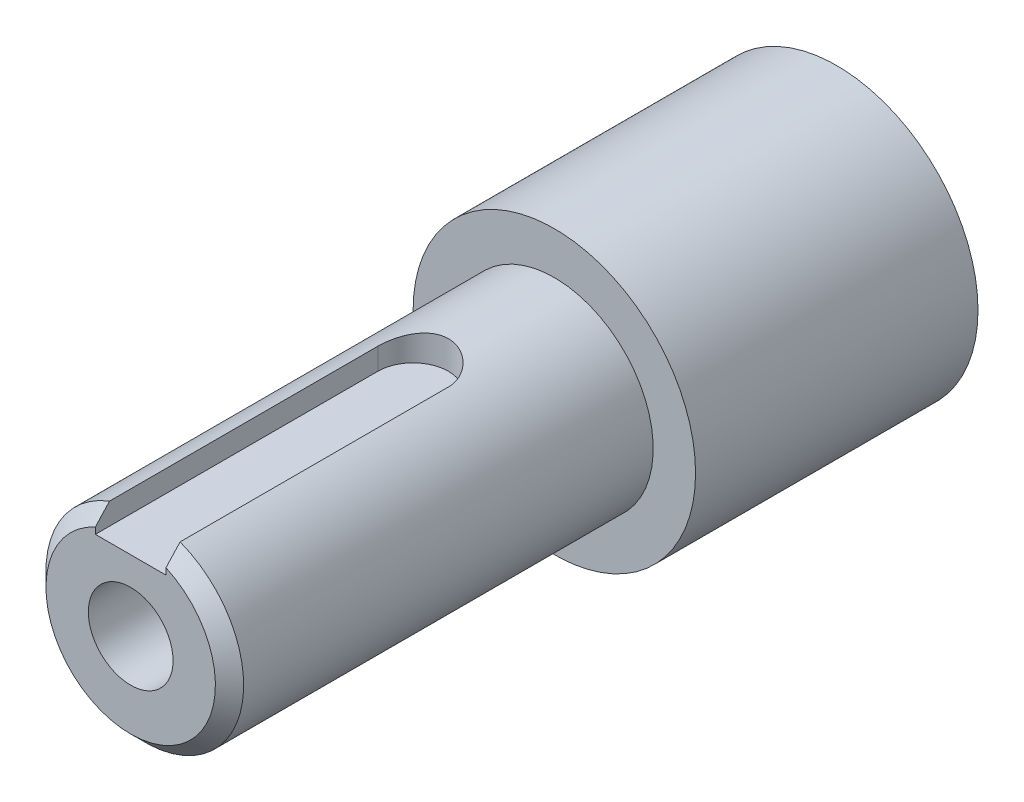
ISO-10303-21;
HEADER;
FILE_DESCRIPTION(('STEP AP214'),'2;1');
FILE_NAME('part.step','',(''),(''),'','','');
FILE_SCHEMA(('AUTOMOTIVE_DESIGN { 1 0 10303 214 1 1 1 1 }'));
ENDSEC;
DATA;
#1=APPLICATION_CONTEXT('core data for automotive mechanical design processes');
#2=APPLICATION_PROTOCOL_DEFINITION('international standard','automotive_design',2000,#1);
#3=PRODUCT_CONTEXT('',#1,'mechanical');
#4=PRODUCT('Part','Part','',(#3));
#5=PRODUCT_RELATED_PRODUCT_CATEGORY('part','',(#4));
#6=PRODUCT_DEFINITION_FORMATION('','',#4);
#7=PRODUCT_DEFINITION_CONTEXT('part definition',#1,'design');
#8=PRODUCT_DEFINITION('design','',#6,#7);
#9=PRODUCT_DEFINITION_SHAPE('','',#8);
#10=(LENGTH_UNIT() NAMED_UNIT(*) SI_UNIT(.MILLI.,.METRE.));
#11=(NAMED_UNIT(*) PLANE_ANGLE_UNIT() SI_UNIT($,.RADIAN.));
#12=(NAMED_UNIT(*) SI_UNIT($,.STERADIAN.) SOLID_ANGLE_UNIT());
#13=UNCERTAINTY_MEASURE_WITH_UNIT(LENGTH_MEASURE(1.E-05),#10,'distance_accuracy_value','');
#14=(GEOMETRIC_REPRESENTATION_CONTEXT(3) GLOBAL_UNCERTAINTY_ASSIGNED_CONTEXT((#13)) GLOBAL_UNIT_ASSIGNED_CONTEXT((#10,
#11,#12)) REPRESENTATION_CONTEXT('',''));
#15=CARTESIAN_POINT('',(0.,0.,0.));
#16=DIRECTION('',(0.,0.,1.));
#17=DIRECTION('',(1.,0.,0.));
#18=AXIS2_PLACEMENT_3D('',#15,#16,#17);
#19=CARTESIAN_POINT('',(0.,0.,-44.));
#20=DIRECTION('',(0.,0.,1.));
#21=DIRECTION('',(1.,0.,0.));
#22=AXIS2_PLACEMENT_3D('',#19,#20,#21);
#23=CYLINDRICAL_SURFACE('',#22,7.);
#24=CARTESIAN_POINT('',(0.,7.,-17.5));
#25=CARTESIAN_POINT('',(0.135839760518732,7.0000020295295,-17.4999971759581));
#26=CARTESIAN_POINT('',(0.271659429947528,6.99601056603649,-17.5111067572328));
#27=CARTESIAN_POINT('',(0.539264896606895,6.98048404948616,-17.5550912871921));
#28=CARTESIAN_POINT('',(0.671050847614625,6.96894928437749,-17.5879654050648));
#29=CARTESIAN_POINT('',(0.926692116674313,6.93958109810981,-17.6741851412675));
#30=CARTESIAN_POINT('',(1.05056137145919,6.92175912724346,-17.7274935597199));
#31=CARTESIAN_POINT('',(1.28759585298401,6.88161078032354,-17.8528887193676));
#32=CARTESIAN_POINT('',(1.40075850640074,6.85928332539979,-17.924979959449));
#33=CARTESIAN_POINT('',(1.61758802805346,6.81147377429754,-18.0888431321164));
#34=CARTESIAN_POINT('',(1.72078015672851,6.78590827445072,-18.1812187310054));
#35=CARTESIAN_POINT('',(1.9105819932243,6.73493522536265,-18.3817463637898));
#36=CARTESIAN_POINT('',(1.99718728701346,6.70952771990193,-18.4899025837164));
#37=CARTESIAN_POINT('',(2.15423735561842,6.6608007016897,-18.7233977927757));
#38=CARTESIAN_POINT('',(2.2240352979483,6.63758107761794,-18.8491947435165));
#39=CARTESIAN_POINT('',(2.34127572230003,6.59714352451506,-19.1117036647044));
#40=CARTESIAN_POINT('',(2.38872619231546,6.57992345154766,-19.2484117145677));
#41=CARTESIAN_POINT('',(2.45809130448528,6.55432038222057,-19.5234228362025));
#42=CARTESIAN_POINT('',(2.48090519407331,6.54562733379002,-19.6614693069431));
#43=CARTESIAN_POINT('',(2.5031615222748,6.53715061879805,-19.9396836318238));
#44=CARTESIAN_POINT('',(2.50261249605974,6.53736369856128,-20.0798506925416));
#45=CARTESIAN_POINT('',(2.4788507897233,6.54640588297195,-20.3503556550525));
#46=CARTESIAN_POINT('',(2.45685161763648,6.55477363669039,-20.4808183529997));
#47=CARTESIAN_POINT('',(2.3928085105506,6.57842082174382,-20.7360615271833));
#48=CARTESIAN_POINT('',(2.35076183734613,6.59370119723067,-20.8608412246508));
#49=CARTESIAN_POINT('',(2.24709566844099,6.62975170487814,-21.1037737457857));
#50=CARTESIAN_POINT('',(2.18514195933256,6.65061447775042,-21.2217696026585));
#51=CARTESIAN_POINT('',(2.04365272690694,6.69544469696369,-21.4460563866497));
#52=CARTESIAN_POINT('',(1.96411154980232,6.71941314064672,-21.5523435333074));
#53=CARTESIAN_POINT('',(1.78403149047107,6.76952498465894,-21.7569595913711));
#54=CARTESIAN_POINT('',(1.68251331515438,6.7957122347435,-21.8544178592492));
#55=CARTESIAN_POINT('',(1.46426184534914,6.84605473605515,-22.0311716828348));
#56=CARTESIAN_POINT('',(1.3475266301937,6.87020973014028,-22.1104649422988));
#57=CARTESIAN_POINT('',(1.10010034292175,6.91416998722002,-22.2494806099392));
#58=CARTESIAN_POINT('',(0.969249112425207,6.93391532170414,-22.3089382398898));
#59=CARTESIAN_POINT('',(0.698523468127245,6.96639167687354,-22.4047158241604));
#60=CARTESIAN_POINT('',(0.558652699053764,6.97912551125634,-22.4410450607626));
#61=CARTESIAN_POINT('',(0.281205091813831,6.99566202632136,-22.4879191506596));
#62=CARTESIAN_POINT('',(0.14385061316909,6.99987103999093,-22.4996381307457));
#63=CARTESIAN_POINT('',(-0.130909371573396,7.00012297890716,-22.5003451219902));
#64=CARTESIAN_POINT('',(-0.268314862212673,6.99616751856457,-22.4893376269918));
#65=CARTESIAN_POINT('',(-0.534368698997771,6.98080349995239,-22.4458138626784));
#66=CARTESIAN_POINT('',(-0.663155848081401,6.96965417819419,-22.4140452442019));
#67=CARTESIAN_POINT('',(-0.913499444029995,6.94128245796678,-22.3308634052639));
#68=CARTESIAN_POINT('',(-1.03505494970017,6.9240592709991,-22.2794476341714));
#69=CARTESIAN_POINT('',(-1.27131790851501,6.88465739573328,-22.1568411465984));
#70=CARTESIAN_POINT('',(-1.38573546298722,6.86235262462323,-22.0851335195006));
#71=CARTESIAN_POINT('',(-1.60127936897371,6.81528395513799,-21.9245725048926));
#72=CARTESIAN_POINT('',(-1.70240114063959,6.79051921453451,-21.8357132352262));
#73=CARTESIAN_POINT('',(-1.89402292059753,6.73966040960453,-21.6378703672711));
#74=CARTESIAN_POINT('',(-1.9836868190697,6.71356479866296,-21.5280752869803));
#75=CARTESIAN_POINT('',(-2.14345525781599,6.66427875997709,-21.2944587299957));
#76=CARTESIAN_POINT('',(-2.21355884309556,6.64108847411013,-21.1706365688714));
#77=CARTESIAN_POINT('',(-2.33208686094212,6.60040332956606,-20.9119351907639));
#78=CARTESIAN_POINT('',(-2.3804881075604,6.58291456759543,-20.7770443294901));
#79=CARTESIAN_POINT('',(-2.45361419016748,6.55601442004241,-20.5002398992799));
#80=CARTESIAN_POINT('',(-2.4783518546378,6.54659865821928,-20.3583301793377));
#81=CARTESIAN_POINT('',(-2.50236255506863,6.53745596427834,-20.080479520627));
#82=CARTESIAN_POINT('',(-2.50304426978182,6.53719306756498,-19.9446767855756));
#83=CARTESIAN_POINT('',(-2.48247035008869,6.54503319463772,-19.6750023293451));
#84=CARTESIAN_POINT('',(-2.46121642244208,6.55313556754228,-19.5411304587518));
#85=CARTESIAN_POINT('',(-2.39843007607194,6.57636700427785,-19.2824994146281));
#86=CARTESIAN_POINT('',(-2.35741961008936,6.59131474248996,-19.1575959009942));
#87=CARTESIAN_POINT('',(-2.25672644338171,6.62646329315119,-18.9163573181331));
#88=CARTESIAN_POINT('',(-2.19703924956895,6.64666536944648,-18.8000243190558));
#89=CARTESIAN_POINT('',(-2.05730313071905,6.69127230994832,-18.5730742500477));
#90=CARTESIAN_POINT('',(-1.97640371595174,6.71583400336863,-18.4630119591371));
#91=CARTESIAN_POINT('',(-1.79790863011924,6.76580411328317,-18.2575724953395));
#92=CARTESIAN_POINT('',(-1.70030791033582,6.79121278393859,-18.162199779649));
#93=CARTESIAN_POINT('',(-1.48566252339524,6.84145445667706,-17.9842780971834));
#94=CARTESIAN_POINT('',(-1.36791750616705,6.86620367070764,-17.9025469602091));
#95=CARTESIAN_POINT('',(-1.11951131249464,6.91104924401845,-17.7600923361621));
#96=CARTESIAN_POINT('',(-0.98885111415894,6.93114595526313,-17.6993672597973));
#97=CARTESIAN_POINT('',(-0.717646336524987,6.96446006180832,-17.6008596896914));
#98=CARTESIAN_POINT('',(-0.577062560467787,6.97764821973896,-17.5631745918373));
#99=CARTESIAN_POINT('',(-0.290976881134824,6.99541542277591,-17.5127511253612));
#100=CARTESIAN_POINT('',(-0.14547691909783,6.99999782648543,-17.5000030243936));
#101=CARTESIAN_POINT('',(0.,7.,-17.5));
#102=B_SPLINE_CURVE_WITH_KNOTS('',3,(#24,#25,#26,#27,#28,#29,#30,#31,#32,#33,#34,#35,#36,#37,
#38,#39,#40,#41,#42,#43,#44,#45,#46,#47,#48,#49,#50,#51,#52,#53,#54,#55,#56,#57,#58,#59,#60,#61,
#62,#63,#64,#65,#66,#67,#68,#69,#70,#71,#72,#73,#74,#75,#76,#77,#78,#79,#80,#81,#82,#83,#84,#85,
#86,#87,#88,#89,#90,#91,#92,#93,#94,#95,#96,#97,#98,#99,#100,#101),.UNSPECIFIED.,.T.,.F.,(4,2,2,
2,2,2,2,2,2,2,2,2,2,2,2,2,2,2,2,2,2,2,2,2,2,2,2,2,2,2,2,2,2,2,2,2,2,2,4),(0.,0.406983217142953,
0.813950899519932,1.22018120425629,1.62650889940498,2.04714572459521,2.46789433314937,
2.90289606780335,3.33774219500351,3.75611562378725,4.17433620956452,4.57019246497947,
4.96610280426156,5.36904149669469,5.77210990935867,6.19956653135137,6.62707715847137,
7.06008524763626,7.49291944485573,7.90458529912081,8.31616976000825,8.71369326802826,
9.11126840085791,9.52005856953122,9.92898918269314,10.3593838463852,10.7897995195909,
11.2206739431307,11.6513146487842,12.0566930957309,12.4620400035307,12.8572208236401,
13.2524967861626,13.6670344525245,14.0816976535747,14.5159343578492,14.9501382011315,
15.3861650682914,15.8220217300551),.UNSPECIFIED.);
#103=CARTESIAN_POINT('',(2.5,6.53834841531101,-20.));
#104=VERTEX_POINT('',#103);
#105=CARTESIAN_POINT('',(-2.5,6.53834841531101,-20.));
#106=VERTEX_POINT('',#105);
#107=EDGE_CURVE('E11',#104,#106,#102,.T.);
#108=ORIENTED_EDGE('',*,*,#107,.F.);
#109=DIRECTION('',(0.,0.,1.));
#110=VECTOR('',#109,1.);
#111=CARTESIAN_POINT('',(2.5,6.53834841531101,-44.));
#112=LINE('',#111,#110);
#113=CARTESIAN_POINT('',(2.5,6.53834841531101,-1.));
#114=VERTEX_POINT('',#113);
#115=EDGE_CURVE('E115',#114,#104,#112,.F.);
#116=ORIENTED_EDGE('',*,*,#115,.F.);
#117=CARTESIAN_POINT('',(0.,0.,-1.));
#118=DIRECTION('',(0.,0.,1.));
#119=DIRECTION('',(1.,0.,0.));
#120=AXIS2_PLACEMENT_3D('',#117,#118,#119);
#121=CIRCLE('',#120,7.);
#122=CARTESIAN_POINT('',(-2.5,6.53834841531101,-1.));
#123=VERTEX_POINT('',#122);
#124=EDGE_CURVE('E128',#114,#123,#121,.F.);
#125=ORIENTED_EDGE('',*,*,#124,.T.);
#126=DIRECTION('',(0.,0.,1.));
#127=VECTOR('',#126,1.);
#128=CARTESIAN_POINT('',(-2.5,6.53834841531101,-44.));
#129=LINE('',#128,#127);
#130=EDGE_CURVE('E50',#106,#123,#129,.T.);
#131=ORIENTED_EDGE('',*,*,#130,.F.);
#132=EDGE_LOOP('',(#108,#116,#125,#131));
#133=FACE_BOUND('',#132,.T.);
#134=CARTESIAN_POINT('',(0.,0.,-30.));
#135=DIRECTION('',(0.,0.,-1.));
#136=DIRECTION('',(-1.,0.,0.));
#137=AXIS2_PLACEMENT_3D('',#134,#135,#136);
#138=CIRCLE('',#137,7.);
#139=CARTESIAN_POINT('',(-7.,0.,-30.));
#140=VERTEX_POINT('',#139);
#141=EDGE_CURVE('E30',#140,#140,#138,.F.);
#142=ORIENTED_EDGE('',*,*,#141,.T.);
#143=EDGE_LOOP('',(#142));
#144=FACE_BOUND('',#143,.T.);
#145=ADVANCED_FACE('F26',(#133,#144),#23,.T.);
#146=CARTESIAN_POINT('',(0.,0.,0.));
#147=DIRECTION('',(0.,0.,1.));
#148=DIRECTION('',(1.,0.,0.));
#149=AXIS2_PLACEMENT_3D('',#146,#147,#148);
#150=PLANE('',#149);
#151=CARTESIAN_POINT('',(0.,0.,0.));
#152=DIRECTION('',(0.,0.,1.));
#153=DIRECTION('',(1.,0.,0.));
#154=AXIS2_PLACEMENT_3D('',#151,#152,#153);
#155=CIRCLE('',#154,3.);
#156=CARTESIAN_POINT('',(3.,0.,0.));
#157=VERTEX_POINT('',#156);
#158=EDGE_CURVE('E97',#157,#157,#155,.T.);
#159=ORIENTED_EDGE('',*,*,#158,.F.);
#160=EDGE_LOOP('',(#159));
#161=FACE_BOUND('',#160,.T.);
#162=DIRECTION('',(0.,1.,0.));
#163=VECTOR('',#162,1.);
#164=CARTESIAN_POINT('',(-2.5,5.,0.));
#165=LINE('',#164,#163);
#166=CARTESIAN_POINT('',(-2.5,5.,0.));
#167=VERTEX_POINT('',#166);
#168=CARTESIAN_POINT('',(-2.5,5.45435605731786,0.));
#169=VERTEX_POINT('',#168);
#170=EDGE_CURVE('E112',#167,#169,#165,.T.);
#171=ORIENTED_EDGE('',*,*,#170,.T.);
#172=CARTESIAN_POINT('',(0.,0.,0.));
#173=DIRECTION('',(0.,0.,1.));
#174=DIRECTION('',(1.,0.,0.));
#175=AXIS2_PLACEMENT_3D('',#172,#173,#174);
#176=CIRCLE('',#175,6.);
#177=CARTESIAN_POINT('',(2.5,5.45435605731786,0.));
#178=VERTEX_POINT('',#177);
#179=EDGE_CURVE('E125',#169,#178,#176,.T.);
#180=ORIENTED_EDGE('',*,*,#179,.T.);
#181=DIRECTION('',(0.,1.,0.));
#182=VECTOR('',#181,1.);
#183=CARTESIAN_POINT('',(2.5,5.,0.));
#184=LINE('',#183,#182);
#185=CARTESIAN_POINT('',(2.5,5.,0.));
#186=VERTEX_POINT('',#185);
#187=EDGE_CURVE('E42',#186,#178,#184,.T.);
#188=ORIENTED_EDGE('',*,*,#187,.F.);
#189=DIRECTION('',(1.,0.,0.));
#190=VECTOR('',#189,1.);
#191=CARTESIAN_POINT('',(-2.5,5.,0.));
#192=LINE('',#191,#190);
#193=EDGE_CURVE('E100',#167,#186,#192,.T.);
#194=ORIENTED_EDGE('',*,*,#193,.F.);
#195=EDGE_LOOP('',(#171,#180,#188,#194));
#196=FACE_BOUND('',#195,.T.);
#197=ADVANCED_FACE('F187',(#161,#196),#150,.T.);
#198=CARTESIAN_POINT('',(0.,0.,0.));
#199=DIRECTION('',(0.,0.,-1.));
#200=DIRECTION('',(-1.,0.,0.));
#201=AXIS2_PLACEMENT_3D('',#198,#199,#200);
#202=CONICAL_SURFACE('',#201,6.,0.785398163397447);
#203=CARTESIAN_POINT('',(-2.5,9.21185083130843,-3.54506132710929));
#204=CARTESIAN_POINT('',(-2.5,8.94541724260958,-3.28796380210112));
#205=CARTESIAN_POINT('',(-2.5,8.67863347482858,-3.03122684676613));
#206=CARTESIAN_POINT('',(-2.5,8.14408657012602,-2.51881331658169));
#207=CARTESIAN_POINT('',(-2.5,7.87632350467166,-2.26313666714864));
#208=CARTESIAN_POINT('',(-2.5,7.33970027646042,-1.75333546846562));
#209=CARTESIAN_POINT('',(-2.5,7.07084107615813,-1.49920990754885));
#210=CARTESIAN_POINT('',(-2.5,6.53132799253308,-0.992822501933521));
#211=CARTESIAN_POINT('',(-2.5,6.26067395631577,-0.740560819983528));
#212=CARTESIAN_POINT('',(-2.5,5.71659389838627,-0.238458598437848));
#213=CARTESIAN_POINT('',(-2.5,5.4431652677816,0.0113791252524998));
#214=CARTESIAN_POINT('',(-2.5,5.03028634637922,0.383040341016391));
#215=CARTESIAN_POINT('',(-2.5,4.89221855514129,0.506398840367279));
#216=CARTESIAN_POINT('',(-2.5,4.61492781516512,0.751821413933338));
#217=CARTESIAN_POINT('',(-2.5,4.47570483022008,0.873885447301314));
#218=CARTESIAN_POINT('',(-2.5,4.19568789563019,1.11646661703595));
#219=CARTESIAN_POINT('',(-2.5,4.05489260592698,1.23698220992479));
#220=CARTESIAN_POINT('',(-2.5,3.77147323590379,1.47582218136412));
#221=CARTESIAN_POINT('',(-2.5,3.62884931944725,1.5941467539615));
#222=CARTESIAN_POINT('',(-2.5,3.34111210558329,1.8279536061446));
#223=CARTESIAN_POINT('',(-2.5,3.19599715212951,1.94343385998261));
#224=CARTESIAN_POINT('',(-2.5,2.97593360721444,2.11361016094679));
#225=CARTESIAN_POINT('',(-2.5,2.90216921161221,2.16983653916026));
#226=CARTESIAN_POINT('',(-2.5,2.75371034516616,2.28105930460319));
#227=CARTESIAN_POINT('',(-2.5,2.67901579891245,2.33605559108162));
#228=CARTESIAN_POINT('',(-2.5,2.60379219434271,2.39032774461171));
#229=B_SPLINE_CURVE_WITH_KNOTS('',3,(#203,#204,#205,#206,#207,#208,#209,#210,#211,#212,#213,
#214,#215,#216,#217,#218,#219,#220,#221,#222,#223,#224,#225,#226,#227,#228),.UNSPECIFIED.,.F.,
.F.,(4,2,2,2,2,2,2,2,2,2,2,2,4),(0.,1.11075581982,2.22143213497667,3.33128359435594,
4.4412308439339,5.55234187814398,6.10778179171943,6.66323918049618,7.21921292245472,
7.77513718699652,8.33144656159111,8.6096856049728,8.88794735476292),.UNSPECIFIED.);
#230=EDGE_CURVE('E35',#123,#169,#229,.T.);
#231=ORIENTED_EDGE('',*,*,#230,.F.);
#232=ORIENTED_EDGE('',*,*,#124,.F.);
#233=CARTESIAN_POINT('',(2.5,2.60379219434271,2.39032774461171));
#234=CARTESIAN_POINT('',(2.5,2.67901579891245,2.33605559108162));
#235=CARTESIAN_POINT('',(2.5,2.75371034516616,2.28105930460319));
#236=CARTESIAN_POINT('',(2.5,2.90216921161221,2.16983653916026));
#237=CARTESIAN_POINT('',(2.5,2.97593360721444,2.11361016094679));
#238=CARTESIAN_POINT('',(2.5,3.19599715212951,1.94343385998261));
#239=CARTESIAN_POINT('',(2.5,3.34111210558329,1.8279536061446));
#240=CARTESIAN_POINT('',(2.5,3.62884931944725,1.5941467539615));
#241=CARTESIAN_POINT('',(2.5,3.77147323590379,1.47582218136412));
#242=CARTESIAN_POINT('',(2.5,4.05489260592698,1.23698220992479));
#243=CARTESIAN_POINT('',(2.5,4.19568789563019,1.11646661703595));
#244=CARTESIAN_POINT('',(2.5,4.47570483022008,0.873885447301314));
#245=CARTESIAN_POINT('',(2.5,4.61492781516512,0.751821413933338));
#246=CARTESIAN_POINT('',(2.5,4.8922185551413,0.506398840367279));
#247=CARTESIAN_POINT('',(2.5,5.03028634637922,0.38304034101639));
#248=CARTESIAN_POINT('',(2.5,5.4431652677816,0.011379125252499));
#249=CARTESIAN_POINT('',(2.5,5.71659389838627,-0.238458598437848));
#250=CARTESIAN_POINT('',(2.5,6.26067395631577,-0.740560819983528));
#251=CARTESIAN_POINT('',(2.5,6.53132799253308,-0.992822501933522));
#252=CARTESIAN_POINT('',(2.5,7.07084107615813,-1.49920990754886));
#253=CARTESIAN_POINT('',(2.5,7.33970027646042,-1.75333546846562));
#254=CARTESIAN_POINT('',(2.5,7.87632350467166,-2.26313666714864));
#255=CARTESIAN_POINT('',(2.5,8.14408657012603,-2.51881331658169));
#256=CARTESIAN_POINT('',(2.5,8.67863347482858,-3.03122684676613));
#257=CARTESIAN_POINT('',(2.5,8.94541724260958,-3.28796380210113));
#258=CARTESIAN_POINT('',(2.5,9.21185083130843,-3.54506132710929));
#259=B_SPLINE_CURVE_WITH_KNOTS('',3,(#233,#234,#235,#236,#237,#238,#239,#240,#241,#242,#243,
#244,#245,#246,#247,#248,#249,#250,#251,#252,#253,#254,#255,#256,#257,#258),.UNSPECIFIED.,.F.,
.F.,(4,2,2,2,2,2,2,2,2,2,2,2,4),(0.,0.278261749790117,0.55650079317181,1.11281016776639,
1.66873443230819,2.22470817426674,2.78016556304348,3.33560547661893,4.44671651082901,
5.55666376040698,6.66651521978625,7.77719153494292,8.88794735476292),.UNSPECIFIED.);
#260=EDGE_CURVE('E131',#178,#114,#259,.T.);
#261=ORIENTED_EDGE('',*,*,#260,.F.);
#262=ORIENTED_EDGE('',*,*,#179,.F.);
#263=EDGE_LOOP('',(#231,#232,#261,#262));
#264=FACE_BOUND('',#263,.T.);
#265=ADVANCED_FACE('F142',(#264),#202,.T.);
#266=CARTESIAN_POINT('',(-2.5,5.,0.));
#267=DIRECTION('',(-1.,0.,0.));
#268=DIRECTION('',(0.,0.,1.));
#269=AXIS2_PLACEMENT_3D('',#266,#267,#268);
#270=PLANE('',#269);
#271=ORIENTED_EDGE('',*,*,#130,.T.);
#272=ORIENTED_EDGE('',*,*,#230,.T.);
#273=ORIENTED_EDGE('',*,*,#170,.F.);
#274=DIRECTION('',(0.,0.,1.));
#275=VECTOR('',#274,1.);
#276=CARTESIAN_POINT('',(-2.5,5.,0.));
#277=LINE('',#276,#275);
#278=CARTESIAN_POINT('',(-2.5,5.,-20.));
#279=VERTEX_POINT('',#278);
#280=EDGE_CURVE('E109',#279,#167,#277,.T.);
#281=ORIENTED_EDGE('',*,*,#280,.F.);
#282=DIRECTION('',(0.,1.,0.));
#283=VECTOR('',#282,1.);
#284=CARTESIAN_POINT('',(-2.5,5.,-20.));
#285=LINE('',#284,#283);
#286=EDGE_CURVE('E116',#279,#106,#285,.T.);
#287=ORIENTED_EDGE('',*,*,#286,.T.);
#288=EDGE_LOOP('',(#271,#272,#273,#281,#287));
#289=FACE_BOUND('',#288,.T.);
#290=ADVANCED_FACE('F152',(#289),#270,.F.);
#291=CARTESIAN_POINT('',(0.,5.,-20.));
#292=DIRECTION('',(0.,1.,0.));
#293=DIRECTION('',(0.,0.,1.));
#294=AXIS2_PLACEMENT_3D('',#291,#292,#293);
#295=CYLINDRICAL_SURFACE('',#294,2.5);
#296=DIRECTION('',(0.,1.,0.));
#297=VECTOR('',#296,1.);
#298=CARTESIAN_POINT('',(2.5,5.,-20.));
#299=LINE('',#298,#297);
#300=CARTESIAN_POINT('',(2.5,5.,-20.));
#301=VERTEX_POINT('',#300);
#302=EDGE_CURVE('E118',#301,#104,#299,.T.);
#303=ORIENTED_EDGE('',*,*,#302,.T.);
#304=ORIENTED_EDGE('',*,*,#107,.T.);
#305=ORIENTED_EDGE('',*,*,#286,.F.);
#306=CARTESIAN_POINT('',(0.,5.,-20.));
#307=DIRECTION('',(0.,1.,0.));
#308=DIRECTION('',(0.,0.,-1.));
#309=AXIS2_PLACEMENT_3D('',#306,#307,#308);
#310=CIRCLE('',#309,2.5);
#311=EDGE_CURVE('E106',#301,#279,#310,.T.);
#312=ORIENTED_EDGE('',*,*,#311,.F.);
#313=EDGE_LOOP('',(#303,#304,#305,#312));
#314=FACE_BOUND('',#313,.T.);
#315=ADVANCED_FACE('F149',(#314),#295,.F.);
#316=CARTESIAN_POINT('',(2.5,5.,0.));
#317=DIRECTION('',(1.,0.,0.));
#318=DIRECTION('',(0.,0.,-1.));
#319=AXIS2_PLACEMENT_3D('',#316,#317,#318);
#320=PLANE('',#319);
#321=ORIENTED_EDGE('',*,*,#115,.T.);
#322=ORIENTED_EDGE('',*,*,#302,.F.);
#323=DIRECTION('',(0.,0.,-1.));
#324=VECTOR('',#323,1.);
#325=CARTESIAN_POINT('',(2.5,5.,0.));
#326=LINE('',#325,#324);
#327=EDGE_CURVE('E103',#186,#301,#326,.T.);
#328=ORIENTED_EDGE('',*,*,#327,.F.);
#329=ORIENTED_EDGE('',*,*,#187,.T.);
#330=ORIENTED_EDGE('',*,*,#260,.T.);
#331=EDGE_LOOP('',(#321,#322,#328,#329,#330));
#332=FACE_BOUND('',#331,.T.);
#333=ADVANCED_FACE('F144',(#332),#320,.F.);
#334=CARTESIAN_POINT('',(0.,5.,-20.));
#335=DIRECTION('',(0.,-1.,0.));
#336=DIRECTION('',(0.,0.,-1.));
#337=AXIS2_PLACEMENT_3D('',#334,#335,#336);
#338=PLANE('',#337);
#339=ORIENTED_EDGE('',*,*,#193,.T.);
#340=ORIENTED_EDGE('',*,*,#327,.T.);
#341=ORIENTED_EDGE('',*,*,#311,.T.);
#342=ORIENTED_EDGE('',*,*,#280,.T.);
#343=EDGE_LOOP('',(#339,#340,#341,#342));
#344=FACE_BOUND('',#343,.T.);
#345=ADVANCED_FACE('F148',(#344),#338,.F.);
#346=CARTESIAN_POINT('',(0.,0.,0.));
#347=DIRECTION('',(0.,0.,1.));
#348=DIRECTION('',(1.,0.,0.));
#349=AXIS2_PLACEMENT_3D('',#346,#347,#348);
#350=CYLINDRICAL_SURFACE('',#349,3.);
#351=CARTESIAN_POINT('',(0.,0.,-22.));
#352=DIRECTION('',(0.,0.,1.));
#353=DIRECTION('',(1.,0.,0.));
#354=AXIS2_PLACEMENT_3D('',#351,#352,#353);
#355=CIRCLE('',#354,3.);
#356=CARTESIAN_POINT('',(3.,0.,-22.));
#357=VERTEX_POINT('',#356);
#358=EDGE_CURVE('E88',#357,#357,#355,.T.);
#359=ORIENTED_EDGE('',*,*,#358,.F.);
#360=EDGE_LOOP('',(#359));
#361=FACE_BOUND('',#360,.T.);
#362=ORIENTED_EDGE('',*,*,#158,.T.);
#363=EDGE_LOOP('',(#362));
#364=FACE_BOUND('',#363,.T.);
#365=ADVANCED_FACE('F161',(#361,#364),#350,.F.);
#366=CARTESIAN_POINT('',(2.49999999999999,0.,-22.));
#367=DIRECTION('',(0.,0.,-1.));
#368=DIRECTION('',(-1.,0.,0.));
#369=AXIS2_PLACEMENT_3D('',#366,#367,#368);
#370=PLANE('',#369);
#371=CARTESIAN_POINT('',(0.,0.,-22.));
#372=DIRECTION('',(0.,0.,1.));
#373=DIRECTION('',(1.,0.,0.));
#374=AXIS2_PLACEMENT_3D('',#371,#372,#373);
#375=CIRCLE('',#374,2.49999999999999);
#376=CARTESIAN_POINT('',(2.49999999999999,0.,-22.));
#377=VERTEX_POINT('',#376);
#378=EDGE_CURVE('E85',#377,#377,#375,.T.);
#379=ORIENTED_EDGE('',*,*,#378,.F.);
#380=EDGE_LOOP('',(#379));
#381=FACE_BOUND('',#380,.T.);
#382=ORIENTED_EDGE('',*,*,#358,.T.);
#383=EDGE_LOOP('',(#382));
#384=FACE_BOUND('',#383,.T.);
#385=ADVANCED_FACE('F165',(#381,#384),#370,.F.);
#386=CARTESIAN_POINT('',(0.,0.,0.));
#387=DIRECTION('',(0.,0.,1.));
#388=DIRECTION('',(1.,0.,0.));
#389=AXIS2_PLACEMENT_3D('',#386,#387,#388);
#390=CYLINDRICAL_SURFACE('',#389,2.49999999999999);
#391=CARTESIAN_POINT('',(0.,0.,-25.));
#392=DIRECTION('',(0.,0.,1.));
#393=DIRECTION('',(1.,0.,0.));
#394=AXIS2_PLACEMENT_3D('',#391,#392,#393);
#395=CIRCLE('',#394,2.49999999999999);
#396=CARTESIAN_POINT('',(2.49999999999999,0.,-25.));
#397=VERTEX_POINT('',#396);
#398=EDGE_CURVE('E83',#397,#397,#395,.T.);
#399=ORIENTED_EDGE('',*,*,#398,.F.);
#400=EDGE_LOOP('',(#399));
#401=FACE_BOUND('',#400,.T.);
#402=ORIENTED_EDGE('',*,*,#378,.T.);
#403=EDGE_LOOP('',(#402));
#404=FACE_BOUND('',#403,.T.);
#405=ADVANCED_FACE('F79',(#401,#404),#390,.F.);
#406=CARTESIAN_POINT('',(0.,0.,-25.));
#407=DIRECTION('',(0.,0.,1.));
#408=DIRECTION('',(1.,0.,0.));
#409=AXIS2_PLACEMENT_3D('',#406,#407,#408);
#410=CONICAL_SURFACE('',#409,2.49999999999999,1.02974425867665);
#411=CARTESIAN_POINT('',(0.,0.,-26.5021515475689));
#412=VERTEX_POINT('',#411);
#413=VERTEX_LOOP('',#412);
#414=FACE_BOUND('',#413,.T.);
#415=ORIENTED_EDGE('',*,*,#398,.T.);
#416=EDGE_LOOP('',(#415));
#417=FACE_BOUND('',#416,.T.);
#418=ADVANCED_FACE('F75',(#414,#417),#410,.F.);
#419=CARTESIAN_POINT('',(0.,0.,-50.));
#420=DIRECTION('',(0.,0.,1.));
#421=DIRECTION('',(1.,0.,0.));
#422=AXIS2_PLACEMENT_3D('',#419,#420,#421);
#423=CYLINDRICAL_SURFACE('',#422,10.);
#424=CARTESIAN_POINT('',(0.,0.,-50.));
#425=DIRECTION('',(0.,0.,-1.));
#426=DIRECTION('',(-1.,0.,0.));
#427=AXIS2_PLACEMENT_3D('',#424,#425,#426);
#428=CIRCLE('',#427,10.);
#429=CARTESIAN_POINT('',(-10.,0.,-50.));
#430=VERTEX_POINT('',#429);
#431=EDGE_CURVE('E91',#430,#430,#428,.T.);
#432=ORIENTED_EDGE('',*,*,#431,.F.);
#433=EDGE_LOOP('',(#432));
#434=FACE_BOUND('',#433,.T.);
#435=CARTESIAN_POINT('',(0.,0.,-30.));
#436=DIRECTION('',(0.,0.,-1.));
#437=DIRECTION('',(-1.,0.,0.));
#438=AXIS2_PLACEMENT_3D('',#435,#436,#437);
#439=CIRCLE('',#438,10.);
#440=CARTESIAN_POINT('',(-10.,0.,-30.));
#441=VERTEX_POINT('',#440);
#442=EDGE_CURVE('E259',#441,#441,#439,.T.);
#443=ORIENTED_EDGE('',*,*,#442,.T.);
#444=EDGE_LOOP('',(#443));
#445=FACE_BOUND('',#444,.T.);
#446=ADVANCED_FACE('F78',(#434,#445),#423,.T.);
#447=CARTESIAN_POINT('',(0.,0.,-50.));
#448=DIRECTION('',(0.,0.,-1.));
#449=DIRECTION('',(-1.,0.,0.));
#450=AXIS2_PLACEMENT_3D('',#447,#448,#449);
#451=PLANE('',#450);
#452=ORIENTED_EDGE('',*,*,#431,.T.);
#453=EDGE_LOOP('',(#452));
#454=FACE_BOUND('',#453,.T.);
#455=ADVANCED_FACE('F174',(#454),#451,.T.);
#456=CARTESIAN_POINT('',(0.,0.,-30.));
#457=DIRECTION('',(0.,0.,-1.));
#458=DIRECTION('',(-1.,0.,0.));
#459=AXIS2_PLACEMENT_3D('',#456,#457,#458);
#460=PLANE('',#459);
#461=ORIENTED_EDGE('',*,*,#141,.F.);
#462=EDGE_LOOP('',(#461));
#463=FACE_BOUND('',#462,.T.);
#464=ORIENTED_EDGE('',*,*,#442,.F.);
#465=EDGE_LOOP('',(#464));
#466=FACE_BOUND('',#465,.T.);
#467=ADVANCED_FACE('F178',(#463,#466),#460,.F.);
#468=CLOSED_SHELL('',(#145,#197,#265,#290,#315,#333,#345,#365,#385,#405,#418,#446,#455,#467));
#469=MANIFOLD_SOLID_BREP('B2',#468);
#470=ADVANCED_BREP_SHAPE_REPRESENTATION('',(#18,#469),#14);
#471=SHAPE_DEFINITION_REPRESENTATION(#9,#470);
ENDSEC;
END-ISO-10303-21;
